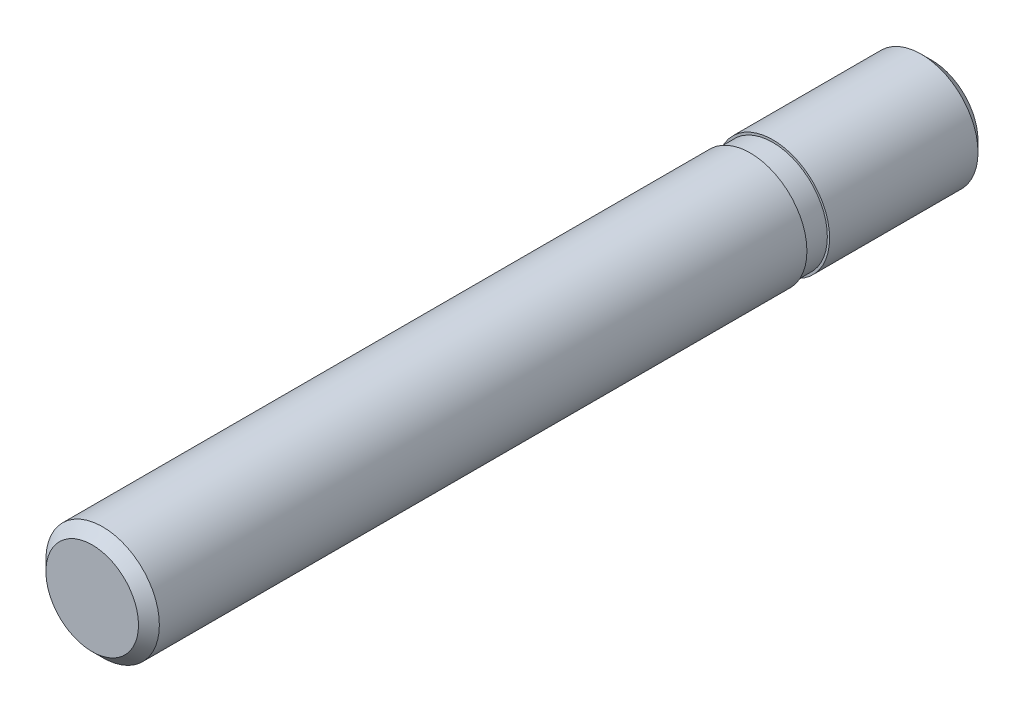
ISO-10303-21;
HEADER;
FILE_DESCRIPTION(('STEP AP214'),'2;1');
FILE_NAME('part.step','',(''),(''),'','','');
FILE_SCHEMA(('AUTOMOTIVE_DESIGN { 1 0 10303 214 1 1 1 1 }'));
ENDSEC;
DATA;
#1=APPLICATION_CONTEXT('core data for automotive mechanical design processes');
#2=APPLICATION_PROTOCOL_DEFINITION('international standard','automotive_design',2000,#1);
#3=PRODUCT_CONTEXT('',#1,'mechanical');
#4=PRODUCT('Part','Part','',(#3));
#5=PRODUCT_RELATED_PRODUCT_CATEGORY('part','',(#4));
#6=PRODUCT_DEFINITION_FORMATION('','',#4);
#7=PRODUCT_DEFINITION_CONTEXT('part definition',#1,'design');
#8=PRODUCT_DEFINITION('design','',#6,#7);
#9=PRODUCT_DEFINITION_SHAPE('','',#8);
#10=(LENGTH_UNIT() NAMED_UNIT(*) SI_UNIT(.MILLI.,.METRE.));
#11=(NAMED_UNIT(*) PLANE_ANGLE_UNIT() SI_UNIT($,.RADIAN.));
#12=(NAMED_UNIT(*) SI_UNIT($,.STERADIAN.) SOLID_ANGLE_UNIT());
#13=UNCERTAINTY_MEASURE_WITH_UNIT(LENGTH_MEASURE(1.E-05),#10,'distance_accuracy_value','');
#14=(GEOMETRIC_REPRESENTATION_CONTEXT(3) GLOBAL_UNCERTAINTY_ASSIGNED_CONTEXT((#13)) GLOBAL_UNIT_ASSIGNED_CONTEXT((#10,
#11,#12)) REPRESENTATION_CONTEXT('',''));
#15=CARTESIAN_POINT('',(0.,0.,0.));
#16=DIRECTION('',(0.,0.,1.));
#17=DIRECTION('',(1.,0.,0.));
#18=AXIS2_PLACEMENT_3D('',#15,#16,#17);
#19=CARTESIAN_POINT('',(0.,2.04,-14.));
#20=DIRECTION('',(0.,0.,-1.));
#21=DIRECTION('',(-1.,0.,0.));
#22=AXIS2_PLACEMENT_3D('',#19,#20,#21);
#23=PLANE('',#22);
#24=CARTESIAN_POINT('',(0.,0.,-14.));
#25=DIRECTION('',(0.,0.,1.));
#26=DIRECTION('',(1.,0.,0.));
#27=AXIS2_PLACEMENT_3D('',#24,#25,#26);
#28=CIRCLE('',#27,4.08000000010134);
#29=CARTESIAN_POINT('',(4.08000000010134,0.,-14.));
#30=VERTEX_POINT('',#29);
#31=EDGE_CURVE('E19',#30,#30,#28,.T.);
#32=ORIENTED_EDGE('',*,*,#31,.F.);
#33=EDGE_LOOP('',(#32));
#34=FACE_BOUND('',#33,.T.);
#35=ADVANCED_FACE('F12',(#34),#23,.T.);
#36=CARTESIAN_POINT('',(0.,0.,-13.080000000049));
#37=DIRECTION('',(0.,0.,1.));
#38=DIRECTION('',(1.,0.,0.));
#39=AXIS2_PLACEMENT_3D('',#36,#37,#38);
#40=CONICAL_SURFACE('',#39,5.0000000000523,0.785398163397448);
#41=CARTESIAN_POINT('',(0.,0.,-13.08));
#42=DIRECTION('',(0.,0.,1.));
#43=DIRECTION('',(1.,0.,0.));
#44=AXIS2_PLACEMENT_3D('',#41,#42,#43);
#45=CIRCLE('',#44,5.);
#46=CARTESIAN_POINT('',(5.,0.,-13.08));
#47=VERTEX_POINT('',#46);
#48=EDGE_CURVE('E23',#47,#47,#45,.T.);
#49=ORIENTED_EDGE('',*,*,#48,.F.);
#50=EDGE_LOOP('',(#49));
#51=FACE_BOUND('',#50,.T.);
#52=ORIENTED_EDGE('',*,*,#31,.T.);
#53=EDGE_LOOP('',(#52));
#54=FACE_BOUND('',#53,.T.);
#55=ADVANCED_FACE('F66',(#51,#54),#40,.T.);
#56=CARTESIAN_POINT('',(0.,0.,4.));
#57=DIRECTION('',(0.,0.,1.));
#58=DIRECTION('',(1.,0.,0.));
#59=AXIS2_PLACEMENT_3D('',#56,#57,#58);
#60=CYLINDRICAL_SURFACE('',#59,5.);
#61=CARTESIAN_POINT('',(0.,0.,0.));
#62=DIRECTION('',(0.,0.,1.));
#63=DIRECTION('',(1.,0.,0.));
#64=AXIS2_PLACEMENT_3D('',#61,#62,#63);
#65=CIRCLE('',#64,5.);
#66=CARTESIAN_POINT('',(5.,0.,0.));
#67=VERTEX_POINT('',#66);
#68=EDGE_CURVE('E28',#67,#67,#65,.T.);
#69=ORIENTED_EDGE('',*,*,#68,.F.);
#70=EDGE_LOOP('',(#69));
#71=FACE_BOUND('',#70,.T.);
#72=ORIENTED_EDGE('',*,*,#48,.T.);
#73=EDGE_LOOP('',(#72));
#74=FACE_BOUND('',#73,.T.);
#75=ADVANCED_FACE('F72',(#71,#74),#60,.T.);
#76=CARTESIAN_POINT('',(0.,0.,0.));
#77=DIRECTION('',(0.,0.,1.));
#78=DIRECTION('',(1.,0.,0.));
#79=AXIS2_PLACEMENT_3D('',#76,#77,#78);
#80=PLANE('',#79);
#81=CARTESIAN_POINT('',(0.,0.,0.));
#82=DIRECTION('',(0.,0.,1.));
#83=DIRECTION('',(1.,0.,0.));
#84=AXIS2_PLACEMENT_3D('',#81,#82,#83);
#85=CIRCLE('',#84,4.8);
#86=CARTESIAN_POINT('',(4.8,0.,0.));
#87=VERTEX_POINT('',#86);
#88=EDGE_CURVE('E8',#87,#87,#85,.T.);
#89=ORIENTED_EDGE('',*,*,#88,.F.);
#90=EDGE_LOOP('',(#89));
#91=FACE_BOUND('',#90,.T.);
#92=ORIENTED_EDGE('',*,*,#68,.T.);
#93=EDGE_LOOP('',(#92));
#94=FACE_BOUND('',#93,.T.);
#95=ADVANCED_FACE('F77',(#91,#94),#80,.T.);
#96=CARTESIAN_POINT('',(0.,0.,-3.11039638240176));
#97=DIRECTION('',(0.,0.,-1.));
#98=DIRECTION('',(-1.,0.,0.));
#99=AXIS2_PLACEMENT_3D('',#96,#97,#98);
#100=CYLINDRICAL_SURFACE('',#99,4.8);
#101=CARTESIAN_POINT('',(0.,0.,2.));
#102=DIRECTION('',(0.,0.,-1.));
#103=DIRECTION('',(-1.,0.,0.));
#104=AXIS2_PLACEMENT_3D('',#101,#102,#103);
#105=CIRCLE('',#104,4.8);
#106=CARTESIAN_POINT('',(-4.8,0.,2.));
#107=VERTEX_POINT('',#106);
#108=EDGE_CURVE('E44',#107,#107,#105,.T.);
#109=ORIENTED_EDGE('',*,*,#108,.T.);
#110=EDGE_LOOP('',(#109));
#111=FACE_BOUND('',#110,.T.);
#112=ORIENTED_EDGE('',*,*,#88,.T.);
#113=EDGE_LOOP('',(#112));
#114=FACE_BOUND('',#113,.T.);
#115=ADVANCED_FACE('F51',(#111,#114),#100,.T.);
#116=CARTESIAN_POINT('',(0.,0.,60.));
#117=DIRECTION('',(0.,0.,1.));
#118=DIRECTION('',(1.,0.,0.));
#119=AXIS2_PLACEMENT_3D('',#116,#117,#118);
#120=PLANE('',#119);
#121=CARTESIAN_POINT('',(0.,0.,60.));
#122=DIRECTION('',(0.,0.,1.));
#123=DIRECTION('',(1.,0.,0.));
#124=AXIS2_PLACEMENT_3D('',#121,#122,#123);
#125=CIRCLE('',#124,4.08);
#126=CARTESIAN_POINT('',(4.08,0.,60.));
#127=VERTEX_POINT('',#126);
#128=EDGE_CURVE('E40',#127,#127,#125,.T.);
#129=ORIENTED_EDGE('',*,*,#128,.T.);
#130=EDGE_LOOP('',(#129));
#131=FACE_BOUND('',#130,.T.);
#132=ADVANCED_FACE('F85',(#131),#120,.T.);
#133=CARTESIAN_POINT('',(0.,0.,60.));
#134=DIRECTION('',(0.,0.,-1.));
#135=DIRECTION('',(-1.,0.,0.));
#136=AXIS2_PLACEMENT_3D('',#133,#134,#135);
#137=CONICAL_SURFACE('',#136,4.08,0.78539816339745);
#138=CARTESIAN_POINT('',(0.,0.,59.08));
#139=DIRECTION('',(0.,0.,1.));
#140=DIRECTION('',(1.,0.,0.));
#141=AXIS2_PLACEMENT_3D('',#138,#139,#140);
#142=CIRCLE('',#141,5.);
#143=CARTESIAN_POINT('',(5.,0.,59.08));
#144=VERTEX_POINT('',#143);
#145=EDGE_CURVE('E31',#144,#144,#142,.F.);
#146=ORIENTED_EDGE('',*,*,#145,.F.);
#147=EDGE_LOOP('',(#146));
#148=FACE_BOUND('',#147,.T.);
#149=ORIENTED_EDGE('',*,*,#128,.F.);
#150=EDGE_LOOP('',(#149));
#151=FACE_BOUND('',#150,.T.);
#152=ADVANCED_FACE('F62',(#148,#151),#137,.T.);
#153=CARTESIAN_POINT('',(0.,0.,4.));
#154=DIRECTION('',(0.,0.,1.));
#155=DIRECTION('',(1.,0.,0.));
#156=AXIS2_PLACEMENT_3D('',#153,#154,#155);
#157=CYLINDRICAL_SURFACE('',#156,5.);
#158=CARTESIAN_POINT('',(0.,0.,2.));
#159=DIRECTION('',(0.,0.,1.));
#160=DIRECTION('',(1.,0.,0.));
#161=AXIS2_PLACEMENT_3D('',#158,#159,#160);
#162=CIRCLE('',#161,5.);
#163=CARTESIAN_POINT('',(5.,0.,2.));
#164=VERTEX_POINT('',#163);
#165=EDGE_CURVE('E35',#164,#164,#162,.T.);
#166=ORIENTED_EDGE('',*,*,#165,.T.);
#167=EDGE_LOOP('',(#166));
#168=FACE_BOUND('',#167,.T.);
#169=ORIENTED_EDGE('',*,*,#145,.T.);
#170=EDGE_LOOP('',(#169));
#171=FACE_BOUND('',#170,.T.);
#172=ADVANCED_FACE('F14',(#168,#171),#157,.T.);
#173=CARTESIAN_POINT('',(0.,0.,2.));
#174=DIRECTION('',(0.,0.,1.));
#175=DIRECTION('',(1.,0.,0.));
#176=AXIS2_PLACEMENT_3D('',#173,#174,#175);
#177=PLANE('',#176);
#178=ORIENTED_EDGE('',*,*,#108,.F.);
#179=EDGE_LOOP('',(#178));
#180=FACE_BOUND('',#179,.T.);
#181=ORIENTED_EDGE('',*,*,#165,.F.);
#182=EDGE_LOOP('',(#181));
#183=FACE_BOUND('',#182,.T.);
#184=ADVANCED_FACE('F53',(#180,#183),#177,.F.);
#185=CLOSED_SHELL('',(#35,#55,#75,#95,#115,#132,#152,#172,#184));
#186=MANIFOLD_SOLID_BREP('B1',#185);
#187=ADVANCED_BREP_SHAPE_REPRESENTATION('',(#18,#186),#14);
#188=SHAPE_DEFINITION_REPRESENTATION(#9,#187);
ENDSEC;
END-ISO-10303-21;
